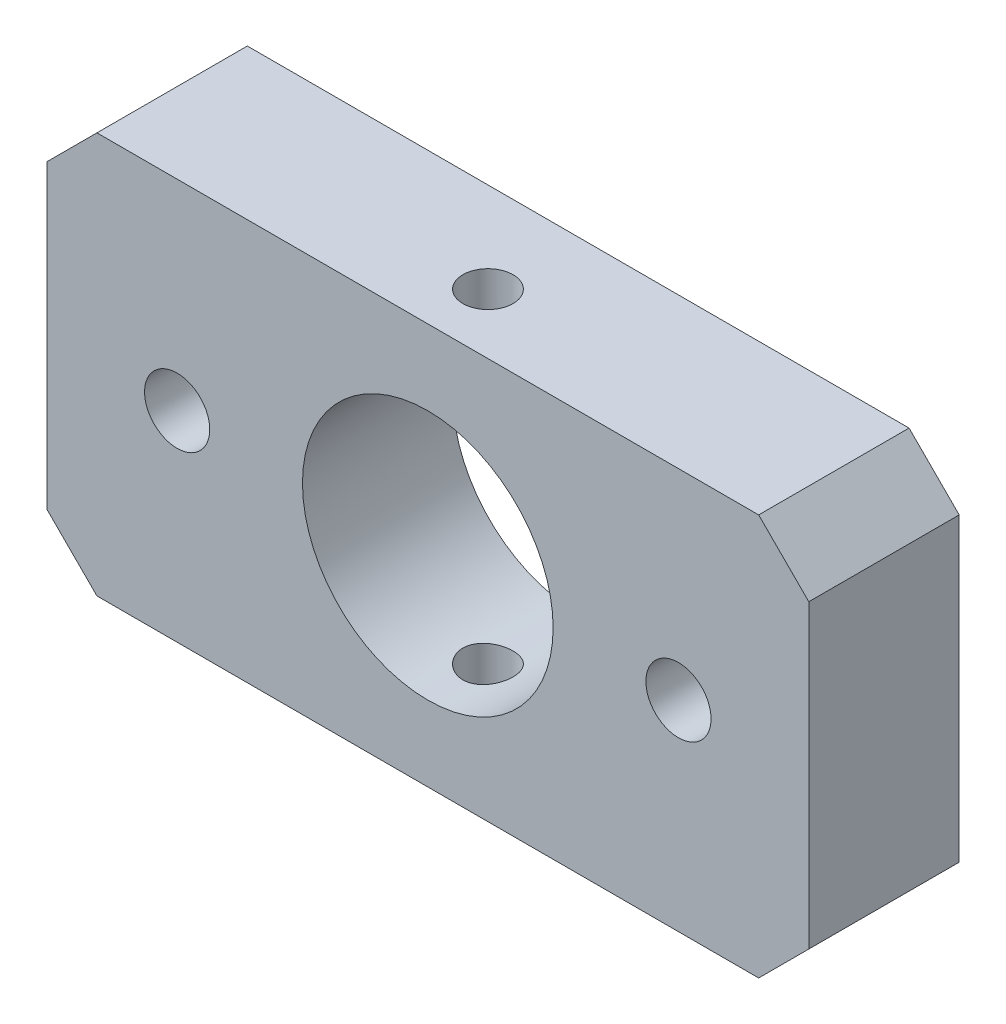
ISO-10303-21;
HEADER;
FILE_DESCRIPTION(('STEP AP214'),'2;1');
FILE_NAME('part.step','',(''),(''),'','','');
FILE_SCHEMA(('AUTOMOTIVE_DESIGN { 1 0 10303 214 1 1 1 1 }'));
ENDSEC;
DATA;
#1=APPLICATION_CONTEXT('core data for automotive mechanical design processes');
#2=APPLICATION_PROTOCOL_DEFINITION('international standard','automotive_design',2000,#1);
#3=PRODUCT_CONTEXT('',#1,'mechanical');
#4=PRODUCT('Part','Part','',(#3));
#5=PRODUCT_RELATED_PRODUCT_CATEGORY('part','',(#4));
#6=PRODUCT_DEFINITION_FORMATION('','',#4);
#7=PRODUCT_DEFINITION_CONTEXT('part definition',#1,'design');
#8=PRODUCT_DEFINITION('design','',#6,#7);
#9=PRODUCT_DEFINITION_SHAPE('','',#8);
#10=(LENGTH_UNIT() NAMED_UNIT(*) SI_UNIT(.MILLI.,.METRE.));
#11=(NAMED_UNIT(*) PLANE_ANGLE_UNIT() SI_UNIT($,.RADIAN.));
#12=(NAMED_UNIT(*) SI_UNIT($,.STERADIAN.) SOLID_ANGLE_UNIT());
#13=UNCERTAINTY_MEASURE_WITH_UNIT(LENGTH_MEASURE(1.E-05),#10,'distance_accuracy_value','');
#14=(GEOMETRIC_REPRESENTATION_CONTEXT(3) GLOBAL_UNCERTAINTY_ASSIGNED_CONTEXT((#13)) GLOBAL_UNIT_ASSIGNED_CONTEXT((#10,
#11,#12)) REPRESENTATION_CONTEXT('',''));
#15=CARTESIAN_POINT('',(0.,0.,0.));
#16=DIRECTION('',(0.,0.,1.));
#17=DIRECTION('',(1.,0.,0.));
#18=AXIS2_PLACEMENT_3D('',#15,#16,#17);
#19=CARTESIAN_POINT('',(-38.,20.,15.));
#20=DIRECTION('',(1.,0.,0.));
#21=DIRECTION('',(0.,1.,0.));
#22=AXIS2_PLACEMENT_3D('',#19,#20,#21);
#23=PLANE('',#22);
#24=DIRECTION('',(0.,-1.,0.));
#25=VECTOR('',#24,1.);
#26=CARTESIAN_POINT('',(-38.,20.,0.));
#27=LINE('',#26,#25);
#28=CARTESIAN_POINT('',(-38.,15.,0.));
#29=VERTEX_POINT('',#28);
#30=CARTESIAN_POINT('',(-38.,-15.,0.));
#31=VERTEX_POINT('',#30);
#32=EDGE_CURVE('E132',#29,#31,#27,.T.);
#33=ORIENTED_EDGE('',*,*,#32,.T.);
#34=DIRECTION('',(0.,0.,1.));
#35=VECTOR('',#34,1.);
#36=CARTESIAN_POINT('',(-38.,-15.,15.));
#37=LINE('',#36,#35);
#38=CARTESIAN_POINT('',(-38.,-15.,15.));
#39=VERTEX_POINT('',#38);
#40=EDGE_CURVE('E11',#31,#39,#37,.T.);
#41=ORIENTED_EDGE('',*,*,#40,.T.);
#42=DIRECTION('',(0.,-1.,0.));
#43=VECTOR('',#42,1.);
#44=CARTESIAN_POINT('',(-38.,20.,15.));
#45=LINE('',#44,#43);
#46=CARTESIAN_POINT('',(-38.,15.,15.));
#47=VERTEX_POINT('',#46);
#48=EDGE_CURVE('E130',#47,#39,#45,.T.);
#49=ORIENTED_EDGE('',*,*,#48,.F.);
#50=DIRECTION('',(0.,0.,-1.));
#51=VECTOR('',#50,1.);
#52=CARTESIAN_POINT('',(-38.,15.,15.));
#53=LINE('',#52,#51);
#54=EDGE_CURVE('E43',#47,#29,#53,.T.);
#55=ORIENTED_EDGE('',*,*,#54,.T.);
#56=EDGE_LOOP('',(#33,#41,#49,#55));
#57=FACE_BOUND('',#56,.T.);
#58=ADVANCED_FACE('F31',(#57),#23,.F.);
#59=CARTESIAN_POINT('',(-38.,-20.,15.));
#60=DIRECTION('',(0.,1.,0.));
#61=DIRECTION('',(-1.,0.,0.));
#62=AXIS2_PLACEMENT_3D('',#59,#60,#61);
#63=PLANE('',#62);
#64=CARTESIAN_POINT('',(0.,-20.,9.));
#65=DIRECTION('',(0.,1.,0.));
#66=DIRECTION('',(-1.,0.,0.));
#67=AXIS2_PLACEMENT_3D('',#64,#65,#66);
#68=CIRCLE('',#67,2.5);
#69=CARTESIAN_POINT('',(-2.5,-20.,9.));
#70=VERTEX_POINT('',#69);
#71=EDGE_CURVE('E265',#70,#70,#68,.T.);
#72=ORIENTED_EDGE('',*,*,#71,.T.);
#73=EDGE_LOOP('',(#72));
#74=FACE_BOUND('',#73,.T.);
#75=DIRECTION('',(1.,0.,0.));
#76=VECTOR('',#75,1.);
#77=CARTESIAN_POINT('',(-38.,-20.,0.));
#78=LINE('',#77,#76);
#79=CARTESIAN_POINT('',(-33.,-20.,0.));
#80=VERTEX_POINT('',#79);
#81=CARTESIAN_POINT('',(33.,-20.,0.));
#82=VERTEX_POINT('',#81);
#83=EDGE_CURVE('E128',#80,#82,#78,.T.);
#84=ORIENTED_EDGE('',*,*,#83,.T.);
#85=DIRECTION('',(0.,0.,1.));
#86=VECTOR('',#85,1.);
#87=CARTESIAN_POINT('',(33.,-20.,15.));
#88=LINE('',#87,#86);
#89=CARTESIAN_POINT('',(33.,-20.,15.));
#90=VERTEX_POINT('',#89);
#91=EDGE_CURVE('E107',#82,#90,#88,.T.);
#92=ORIENTED_EDGE('',*,*,#91,.T.);
#93=DIRECTION('',(1.,0.,0.));
#94=VECTOR('',#93,1.);
#95=CARTESIAN_POINT('',(-38.,-20.,15.));
#96=LINE('',#95,#94);
#97=CARTESIAN_POINT('',(-33.,-20.,15.));
#98=VERTEX_POINT('',#97);
#99=EDGE_CURVE('E138',#98,#90,#96,.T.);
#100=ORIENTED_EDGE('',*,*,#99,.F.);
#101=DIRECTION('',(0.,0.,-1.));
#102=VECTOR('',#101,1.);
#103=CARTESIAN_POINT('',(-33.,-20.,15.));
#104=LINE('',#103,#102);
#105=EDGE_CURVE('E112',#98,#80,#104,.T.);
#106=ORIENTED_EDGE('',*,*,#105,.T.);
#107=EDGE_LOOP('',(#84,#92,#100,#106));
#108=FACE_BOUND('',#107,.T.);
#109=ADVANCED_FACE('F207',(#74,#108),#63,.F.);
#110=CARTESIAN_POINT('',(38.,20.,15.));
#111=DIRECTION('',(-1.,0.,0.));
#112=DIRECTION('',(0.,0.,1.));
#113=AXIS2_PLACEMENT_3D('',#110,#111,#112);
#114=PLANE('',#113);
#115=DIRECTION('',(0.,1.,0.));
#116=VECTOR('',#115,1.);
#117=CARTESIAN_POINT('',(38.,20.,15.));
#118=LINE('',#117,#116);
#119=CARTESIAN_POINT('',(38.,-15.,15.));
#120=VERTEX_POINT('',#119);
#121=CARTESIAN_POINT('',(38.,15.,15.));
#122=VERTEX_POINT('',#121);
#123=EDGE_CURVE('E121',#120,#122,#118,.T.);
#124=ORIENTED_EDGE('',*,*,#123,.F.);
#125=DIRECTION('',(0.,0.,-1.));
#126=VECTOR('',#125,1.);
#127=CARTESIAN_POINT('',(38.,-15.,15.));
#128=LINE('',#127,#126);
#129=CARTESIAN_POINT('',(38.,-15.,0.));
#130=VERTEX_POINT('',#129);
#131=EDGE_CURVE('E106',#120,#130,#128,.T.);
#132=ORIENTED_EDGE('',*,*,#131,.T.);
#133=DIRECTION('',(0.,1.,0.));
#134=VECTOR('',#133,1.);
#135=CARTESIAN_POINT('',(38.,20.,0.));
#136=LINE('',#135,#134);
#137=CARTESIAN_POINT('',(38.,15.,0.));
#138=VERTEX_POINT('',#137);
#139=EDGE_CURVE('E119',#130,#138,#136,.T.);
#140=ORIENTED_EDGE('',*,*,#139,.T.);
#141=DIRECTION('',(0.,0.,1.));
#142=VECTOR('',#141,1.);
#143=CARTESIAN_POINT('',(38.,15.,15.));
#144=LINE('',#143,#142);
#145=EDGE_CURVE('E123',#138,#122,#144,.T.);
#146=ORIENTED_EDGE('',*,*,#145,.T.);
#147=EDGE_LOOP('',(#124,#132,#140,#146));
#148=FACE_BOUND('',#147,.T.);
#149=ADVANCED_FACE('F118',(#148),#114,.F.);
#150=CARTESIAN_POINT('',(-38.,20.,15.));
#151=DIRECTION('',(0.,-1.,0.));
#152=DIRECTION('',(0.,0.,-1.));
#153=AXIS2_PLACEMENT_3D('',#150,#151,#152);
#154=PLANE('',#153);
#155=CARTESIAN_POINT('',(0.,20.,9.));
#156=DIRECTION('',(0.,1.,0.));
#157=DIRECTION('',(0.,0.,1.));
#158=AXIS2_PLACEMENT_3D('',#155,#156,#157);
#159=CIRCLE('',#158,2.5);
#160=CARTESIAN_POINT('',(0.,20.,11.5));
#161=VERTEX_POINT('',#160);
#162=EDGE_CURVE('E168',#161,#161,#159,.T.);
#163=ORIENTED_EDGE('',*,*,#162,.F.);
#164=EDGE_LOOP('',(#163));
#165=FACE_BOUND('',#164,.T.);
#166=DIRECTION('',(-1.,0.,0.));
#167=VECTOR('',#166,1.);
#168=CARTESIAN_POINT('',(-38.,20.,15.));
#169=LINE('',#168,#167);
#170=CARTESIAN_POINT('',(33.,20.,15.));
#171=VERTEX_POINT('',#170);
#172=CARTESIAN_POINT('',(-33.,20.,15.));
#173=VERTEX_POINT('',#172);
#174=EDGE_CURVE('E142',#171,#173,#169,.T.);
#175=ORIENTED_EDGE('',*,*,#174,.F.);
#176=DIRECTION('',(0.,0.,-1.));
#177=VECTOR('',#176,1.);
#178=CARTESIAN_POINT('',(33.,20.,15.));
#179=LINE('',#178,#177);
#180=CARTESIAN_POINT('',(33.,20.,0.));
#181=VERTEX_POINT('',#180);
#182=EDGE_CURVE('E160',#171,#181,#179,.T.);
#183=ORIENTED_EDGE('',*,*,#182,.T.);
#184=DIRECTION('',(-1.,0.,0.));
#185=VECTOR('',#184,1.);
#186=CARTESIAN_POINT('',(-38.,20.,0.));
#187=LINE('',#186,#185);
#188=CARTESIAN_POINT('',(-33.,20.,0.));
#189=VERTEX_POINT('',#188);
#190=EDGE_CURVE('E127',#181,#189,#187,.T.);
#191=ORIENTED_EDGE('',*,*,#190,.T.);
#192=DIRECTION('',(0.,0.,1.));
#193=VECTOR('',#192,1.);
#194=CARTESIAN_POINT('',(-33.,20.,15.));
#195=LINE('',#194,#193);
#196=EDGE_CURVE('E51',#189,#173,#195,.T.);
#197=ORIENTED_EDGE('',*,*,#196,.T.);
#198=EDGE_LOOP('',(#175,#183,#191,#197));
#199=FACE_BOUND('',#198,.T.);
#200=ADVANCED_FACE('F225',(#165,#199),#154,.F.);
#201=CARTESIAN_POINT('',(-38.,20.,15.));
#202=DIRECTION('',(0.,0.,1.));
#203=DIRECTION('',(1.,0.,0.));
#204=AXIS2_PLACEMENT_3D('',#201,#202,#203);
#205=PLANE('',#204);
#206=CARTESIAN_POINT('',(-25.,0.,15.));
#207=DIRECTION('',(0.,0.,1.));
#208=DIRECTION('',(1.,0.,0.));
#209=AXIS2_PLACEMENT_3D('',#206,#207,#208);
#210=CIRCLE('',#209,3.25);
#211=CARTESIAN_POINT('',(-21.75,0.,15.));
#212=VERTEX_POINT('',#211);
#213=EDGE_CURVE('E262',#212,#212,#210,.T.);
#214=ORIENTED_EDGE('',*,*,#213,.F.);
#215=EDGE_LOOP('',(#214));
#216=FACE_BOUND('',#215,.T.);
#217=CARTESIAN_POINT('',(25.,0.,15.));
#218=DIRECTION('',(0.,0.,1.));
#219=DIRECTION('',(1.,0.,0.));
#220=AXIS2_PLACEMENT_3D('',#217,#218,#219);
#221=CIRCLE('',#220,3.25);
#222=CARTESIAN_POINT('',(28.25,0.,15.));
#223=VERTEX_POINT('',#222);
#224=EDGE_CURVE('E258',#223,#223,#221,.T.);
#225=ORIENTED_EDGE('',*,*,#224,.F.);
#226=EDGE_LOOP('',(#225));
#227=FACE_BOUND('',#226,.T.);
#228=CARTESIAN_POINT('',(0.,0.,15.));
#229=DIRECTION('',(0.,0.,1.));
#230=DIRECTION('',(1.,0.,0.));
#231=AXIS2_PLACEMENT_3D('',#228,#229,#230);
#232=CIRCLE('',#231,12.5);
#233=CARTESIAN_POINT('',(12.5,0.,15.));
#234=VERTEX_POINT('',#233);
#235=EDGE_CURVE('E252',#234,#234,#232,.T.);
#236=ORIENTED_EDGE('',*,*,#235,.F.);
#237=EDGE_LOOP('',(#236));
#238=FACE_BOUND('',#237,.T.);
#239=ORIENTED_EDGE('',*,*,#99,.T.);
#240=DIRECTION('',(-0.707106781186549,-0.707106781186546,0.));
#241=VECTOR('',#240,1.);
#242=CARTESIAN_POINT('',(17.4999999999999,-35.5000000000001,15.));
#243=LINE('',#242,#241);
#244=EDGE_CURVE('E157',#90,#120,#243,.F.);
#245=ORIENTED_EDGE('',*,*,#244,.T.);
#246=ORIENTED_EDGE('',*,*,#123,.T.);
#247=DIRECTION('',(0.707106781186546,-0.70710678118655,0.));
#248=VECTOR('',#247,1.);
#249=CARTESIAN_POINT('',(-2.49999999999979,55.5,15.));
#250=LINE('',#249,#248);
#251=EDGE_CURVE('E58',#122,#171,#250,.F.);
#252=ORIENTED_EDGE('',*,*,#251,.T.);
#253=ORIENTED_EDGE('',*,*,#174,.T.);
#254=DIRECTION('',(0.707106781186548,0.707106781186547,0.));
#255=VECTOR('',#254,1.);
#256=CARTESIAN_POINT('',(-35.5,17.5,15.));
#257=LINE('',#256,#255);
#258=EDGE_CURVE('E152',#173,#47,#257,.F.);
#259=ORIENTED_EDGE('',*,*,#258,.T.);
#260=ORIENTED_EDGE('',*,*,#48,.T.);
#261=DIRECTION('',(-0.707106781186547,0.707106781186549,0.));
#262=VECTOR('',#261,1.);
#263=CARTESIAN_POINT('',(-55.5,2.50000000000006,15.));
#264=LINE('',#263,#262);
#265=EDGE_CURVE('E154',#39,#98,#264,.F.);
#266=ORIENTED_EDGE('',*,*,#265,.T.);
#267=EDGE_LOOP('',(#239,#245,#246,#252,#253,#259,#260,#266));
#268=FACE_BOUND('',#267,.T.);
#269=ADVANCED_FACE('F222',(#216,#227,#238,#268),#205,.T.);
#270=CARTESIAN_POINT('',(-38.,20.,0.));
#271=DIRECTION('',(0.,0.,1.));
#272=DIRECTION('',(1.,0.,0.));
#273=AXIS2_PLACEMENT_3D('',#270,#271,#272);
#274=PLANE('',#273);
#275=CARTESIAN_POINT('',(-25.,0.,0.));
#276=DIRECTION('',(0.,0.,1.));
#277=DIRECTION('',(1.,0.,0.));
#278=AXIS2_PLACEMENT_3D('',#275,#276,#277);
#279=CIRCLE('',#278,3.25);
#280=CARTESIAN_POINT('',(-21.75,0.,0.));
#281=VERTEX_POINT('',#280);
#282=EDGE_CURVE('E245',#281,#281,#279,.T.);
#283=ORIENTED_EDGE('',*,*,#282,.T.);
#284=EDGE_LOOP('',(#283));
#285=FACE_BOUND('',#284,.T.);
#286=CARTESIAN_POINT('',(25.,0.,0.));
#287=DIRECTION('',(0.,0.,1.));
#288=DIRECTION('',(1.,0.,0.));
#289=AXIS2_PLACEMENT_3D('',#286,#287,#288);
#290=CIRCLE('',#289,3.25);
#291=CARTESIAN_POINT('',(28.25,0.,0.));
#292=VERTEX_POINT('',#291);
#293=EDGE_CURVE('E248',#292,#292,#290,.T.);
#294=ORIENTED_EDGE('',*,*,#293,.T.);
#295=EDGE_LOOP('',(#294));
#296=FACE_BOUND('',#295,.T.);
#297=CARTESIAN_POINT('',(0.,0.,0.));
#298=DIRECTION('',(0.,0.,1.));
#299=DIRECTION('',(1.,0.,0.));
#300=AXIS2_PLACEMENT_3D('',#297,#298,#299);
#301=CIRCLE('',#300,12.5);
#302=CARTESIAN_POINT('',(12.5,0.,0.));
#303=VERTEX_POINT('',#302);
#304=EDGE_CURVE('E218',#303,#303,#301,.T.);
#305=ORIENTED_EDGE('',*,*,#304,.T.);
#306=EDGE_LOOP('',(#305));
#307=FACE_BOUND('',#306,.T.);
#308=ORIENTED_EDGE('',*,*,#139,.F.);
#309=DIRECTION('',(0.707106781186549,0.707106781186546,0.));
#310=VECTOR('',#309,1.);
#311=CARTESIAN_POINT('',(38.,-15.,0.));
#312=LINE('',#311,#310);
#313=EDGE_CURVE('E102',#130,#82,#312,.F.);
#314=ORIENTED_EDGE('',*,*,#313,.T.);
#315=ORIENTED_EDGE('',*,*,#83,.F.);
#316=DIRECTION('',(0.707106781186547,-0.707106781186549,0.));
#317=VECTOR('',#316,1.);
#318=CARTESIAN_POINT('',(-33.,-20.,0.));
#319=LINE('',#318,#317);
#320=EDGE_CURVE('E146',#80,#31,#319,.F.);
#321=ORIENTED_EDGE('',*,*,#320,.T.);
#322=ORIENTED_EDGE('',*,*,#32,.F.);
#323=DIRECTION('',(-0.707106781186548,-0.707106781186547,0.));
#324=VECTOR('',#323,1.);
#325=CARTESIAN_POINT('',(-38.,15.,0.));
#326=LINE('',#325,#324);
#327=EDGE_CURVE('E122',#29,#189,#326,.F.);
#328=ORIENTED_EDGE('',*,*,#327,.T.);
#329=ORIENTED_EDGE('',*,*,#190,.F.);
#330=DIRECTION('',(-0.707106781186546,0.70710678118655,0.));
#331=VECTOR('',#330,1.);
#332=CARTESIAN_POINT('',(33.,20.,0.));
#333=LINE('',#332,#331);
#334=EDGE_CURVE('E113',#181,#138,#333,.F.);
#335=ORIENTED_EDGE('',*,*,#334,.T.);
#336=EDGE_LOOP('',(#308,#314,#315,#321,#322,#328,#329,#335));
#337=FACE_BOUND('',#336,.T.);
#338=ADVANCED_FACE('F125',(#285,#296,#307,#337),#274,.F.);
#339=CARTESIAN_POINT('',(0.,0.,0.));
#340=DIRECTION('',(0.,0.,1.));
#341=DIRECTION('',(1.,0.,0.));
#342=AXIS2_PLACEMENT_3D('',#339,#340,#341);
#343=CYLINDRICAL_SURFACE('',#342,12.5);
#344=CARTESIAN_POINT('',(0.,-12.5,11.5));
#345=CARTESIAN_POINT('',(-0.138942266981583,-12.4999974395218,11.4999948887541));
#346=CARTESIAN_POINT('',(-0.277949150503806,-12.4976596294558,11.4883778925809));
#347=CARTESIAN_POINT('',(-0.552033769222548,-12.4885591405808,11.4422537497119));
#348=CARTESIAN_POINT('',(-0.687108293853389,-12.4817929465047,11.4077284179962));
#349=CARTESIAN_POINT('',(-0.949325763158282,-12.4645912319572,11.316896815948));
#350=CARTESIAN_POINT('',(-1.07647616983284,-12.454159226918,11.2606114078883));
#351=CARTESIAN_POINT('',(-1.31951997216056,-12.4307599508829,11.1279193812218));
#352=CARTESIAN_POINT('',(-1.43541403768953,-12.4177928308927,11.051513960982));
#353=CARTESIAN_POINT('',(-1.65423369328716,-12.3905541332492,10.8796537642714));
#354=CARTESIAN_POINT('',(-1.75698487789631,-12.3762686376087,10.783979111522));
#355=CARTESIAN_POINT('',(-1.94509189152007,-12.3481045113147,10.5767689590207));
#356=CARTESIAN_POINT('',(-2.03044636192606,-12.3342259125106,10.4652322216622));
#357=CARTESIAN_POINT('',(-2.18207938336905,-12.3083110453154,10.2282095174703));
#358=CARTESIAN_POINT('',(-2.24817734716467,-12.2962926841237,10.1026058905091));
#359=CARTESIAN_POINT('',(-2.35826416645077,-12.2756567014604,9.8417954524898));
#360=CARTESIAN_POINT('',(-2.40225520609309,-12.267038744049,9.70658959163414));
#361=CARTESIAN_POINT('',(-2.46631324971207,-12.2543201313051,9.4322890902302));
#362=CARTESIAN_POINT('',(-2.48668624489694,-12.2501617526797,9.29326863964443));
#363=CARTESIAN_POINT('',(-2.5038803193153,-12.2466593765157,9.01372544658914));
#364=CARTESIAN_POINT('',(-2.50070380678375,-12.247314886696,8.87320285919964));
#365=CARTESIAN_POINT('',(-2.47113643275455,-12.2533137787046,8.59688302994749));
#366=CARTESIAN_POINT('',(-2.44509635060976,-12.2585863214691,8.46104648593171));
#367=CARTESIAN_POINT('',(-2.37109471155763,-12.273113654,8.19570980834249));
#368=CARTESIAN_POINT('',(-2.3231321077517,-12.2823686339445,8.06620997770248));
#369=CARTESIAN_POINT('',(-2.2063119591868,-12.3038904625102,7.816211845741));
#370=CARTESIAN_POINT('',(-2.13731537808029,-12.3161772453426,7.69578030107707));
#371=CARTESIAN_POINT('',(-1.9804839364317,-12.3423654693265,7.46807287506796));
#372=CARTESIAN_POINT('',(-1.89264691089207,-12.3562670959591,7.36079850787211));
#373=CARTESIAN_POINT('',(-1.69874983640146,-12.3844255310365,7.16042649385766));
#374=CARTESIAN_POINT('',(-1.59239040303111,-12.3986842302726,7.06761858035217));
#375=CARTESIAN_POINT('',(-1.36546256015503,-12.4257212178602,6.90111538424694));
#376=CARTESIAN_POINT('',(-1.24489396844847,-12.4384994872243,6.82742034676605));
#377=CARTESIAN_POINT('',(-0.992648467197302,-12.4611672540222,6.70118122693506));
#378=CARTESIAN_POINT('',(-0.86095454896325,-12.4710522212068,6.64867026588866));
#379=CARTESIAN_POINT('',(-0.590372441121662,-12.4867852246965,6.56659881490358));
#380=CARTESIAN_POINT('',(-0.451485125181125,-12.4926337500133,6.53703554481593));
#381=CARTESIAN_POINT('',(-0.172948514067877,-12.4995667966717,6.50210886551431));
#382=CARTESIAN_POINT('',(-0.0333508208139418,-12.5007293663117,6.49634895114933));
#383=CARTESIAN_POINT('',(0.244812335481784,-12.4983762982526,6.50812464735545));
#384=CARTESIAN_POINT('',(0.383377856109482,-12.4948609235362,6.52565894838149));
#385=CARTESIAN_POINT('',(0.654264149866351,-12.4835958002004,6.58319593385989));
#386=CARTESIAN_POINT('',(0.786629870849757,-12.4758844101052,6.62299517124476));
#387=CARTESIAN_POINT('',(1.04280906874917,-12.4570888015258,6.72370995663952));
#388=CARTESIAN_POINT('',(1.16662190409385,-12.4460043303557,6.78462708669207));
#389=CARTESIAN_POINT('',(1.40385293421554,-12.4214977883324,6.92670622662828));
#390=CARTESIAN_POINT('',(1.51712531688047,-12.4080487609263,7.00810695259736));
#391=CARTESIAN_POINT('',(1.72854504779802,-12.3803683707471,7.1885229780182));
#392=CARTESIAN_POINT('',(1.82669077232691,-12.3661369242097,7.28754016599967));
#393=CARTESIAN_POINT('',(2.00660147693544,-12.3382325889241,7.50218337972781));
#394=CARTESIAN_POINT('',(2.08809425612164,-12.3245715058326,7.61803936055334));
#395=CARTESIAN_POINT('',(2.23046355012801,-12.2996047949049,7.86202840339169));
#396=CARTESIAN_POINT('',(2.29134088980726,-12.2882990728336,7.99016097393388));
#397=CARTESIAN_POINT('',(2.3903796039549,-12.2694185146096,8.25442061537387));
#398=CARTESIAN_POINT('',(2.42865874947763,-12.2618243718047,8.3905021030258));
#399=CARTESIAN_POINT('',(2.48177162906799,-12.2511859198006,8.66733363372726));
#400=CARTESIAN_POINT('',(2.49660842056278,-12.2481410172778,8.80808306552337));
#401=CARTESIAN_POINT('',(2.50230227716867,-12.2469787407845,9.08752216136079));
#402=CARTESIAN_POINT('',(2.49358947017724,-12.2487729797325,9.22620287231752));
#403=CARTESIAN_POINT('',(2.45338076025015,-12.2568893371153,9.50007912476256));
#404=CARTESIAN_POINT('',(2.42188504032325,-12.2632114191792,9.63527469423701));
#405=CARTESIAN_POINT('',(2.33719642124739,-12.279631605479,9.89806927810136));
#406=CARTESIAN_POINT('',(2.28405626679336,-12.2897205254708,10.025685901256));
#407=CARTESIAN_POINT('',(2.15763661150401,-12.3125428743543,10.2702593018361));
#408=CARTESIAN_POINT('',(2.08435542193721,-12.3252765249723,10.3872151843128));
#409=CARTESIAN_POINT('',(1.91826478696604,-12.3522240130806,10.6092889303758));
#410=CARTESIAN_POINT('',(1.82514471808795,-12.3664593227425,10.714171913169));
#411=CARTESIAN_POINT('',(1.62266092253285,-12.3946520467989,10.9069655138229));
#412=CARTESIAN_POINT('',(1.51329346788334,-12.4086093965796,10.9948722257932));
#413=CARTESIAN_POINT('',(1.28004407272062,-12.4348458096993,11.1520866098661));
#414=CARTESIAN_POINT('',(1.15602221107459,-12.4471057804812,11.2211900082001));
#415=CARTESIAN_POINT('',(0.897915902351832,-12.468378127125,11.3374653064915));
#416=CARTESIAN_POINT('',(0.763840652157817,-12.4773934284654,11.3846569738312));
#417=CARTESIAN_POINT('',(0.52455372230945,-12.4894093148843,11.4466298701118));
#418=CARTESIAN_POINT('',(0.420704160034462,-12.4933575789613,11.4666079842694));
#419=CARTESIAN_POINT('',(0.211248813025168,-12.4986538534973,11.4932947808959));
#420=CARTESIAN_POINT('',(0.105643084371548,-12.5000019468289,11.5000038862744));
#421=CARTESIAN_POINT('',(0.,-12.5,11.5));
#422=B_SPLINE_CURVE_WITH_KNOTS('',3,(#344,#345,#346,#347,#348,#349,#350,#351,#352,#353,#354,
#355,#356,#357,#358,#359,#360,#361,#362,#363,#364,#365,#366,#367,#368,#369,#370,#371,#372,#373,
#374,#375,#376,#377,#378,#379,#380,#381,#382,#383,#384,#385,#386,#387,#388,#389,#390,#391,#392,
#393,#394,#395,#396,#397,#398,#399,#400,#401,#402,#403,#404,#405,#406,#407,#408,#409,#410,#411,
#412,#413,#414,#415,#416,#417,#418,#419,#420,#421),.UNSPECIFIED.,.T.,.F.,(4,2,2,2,2,2,2,2,2,2,2,
2,2,2,2,2,2,2,2,2,2,2,2,2,2,2,2,2,2,2,2,2,2,2,2,2,2,2,4),(0.,0.416440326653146,
0.833211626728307,1.24958433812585,1.66593225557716,2.08733167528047,2.50876399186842,
2.93402987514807,3.35925373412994,3.77890462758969,4.19851260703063,4.61179317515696,
5.02509348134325,5.44118725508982,5.85732886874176,6.28095631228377,6.70458918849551,
7.1288818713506,7.5531231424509,7.97026839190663,8.38739019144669,8.80076134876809,
9.21416348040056,9.63262665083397,10.0511347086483,10.4760157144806,10.9008797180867,
11.3235095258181,11.7460842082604,12.1609930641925,12.5758985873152,12.9897990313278,
13.4037341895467,13.8247019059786,14.2457663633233,14.6712374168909,15.096323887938,
15.4129693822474,15.7296047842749),.UNSPECIFIED.);
#423=CARTESIAN_POINT('',(0.,-12.5,11.5));
#424=VERTEX_POINT('',#423);
#425=EDGE_CURVE('E34',#424,#424,#422,.T.);
#426=ORIENTED_EDGE('',*,*,#425,.T.);
#427=EDGE_LOOP('',(#426));
#428=FACE_BOUND('',#427,.T.);
#429=CARTESIAN_POINT('',(0.,12.5,11.5));
#430=CARTESIAN_POINT('',(0.138942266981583,12.4999974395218,11.4999948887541));
#431=CARTESIAN_POINT('',(0.277949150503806,12.4976596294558,11.4883778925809));
#432=CARTESIAN_POINT('',(0.552033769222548,12.4885591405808,11.4422537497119));
#433=CARTESIAN_POINT('',(0.687108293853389,12.4817929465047,11.4077284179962));
#434=CARTESIAN_POINT('',(0.949325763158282,12.4645912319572,11.316896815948));
#435=CARTESIAN_POINT('',(1.07647616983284,12.454159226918,11.2606114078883));
#436=CARTESIAN_POINT('',(1.31951997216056,12.4307599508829,11.1279193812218));
#437=CARTESIAN_POINT('',(1.43541403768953,12.4177928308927,11.051513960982));
#438=CARTESIAN_POINT('',(1.65423369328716,12.3905541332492,10.8796537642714));
#439=CARTESIAN_POINT('',(1.75698487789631,12.3762686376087,10.783979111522));
#440=CARTESIAN_POINT('',(1.94509189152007,12.3481045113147,10.5767689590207));
#441=CARTESIAN_POINT('',(2.03044636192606,12.3342259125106,10.4652322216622));
#442=CARTESIAN_POINT('',(2.18207938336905,12.3083110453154,10.2282095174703));
#443=CARTESIAN_POINT('',(2.24817734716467,12.2962926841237,10.1026058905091));
#444=CARTESIAN_POINT('',(2.35826416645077,12.2756567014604,9.8417954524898));
#445=CARTESIAN_POINT('',(2.40225520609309,12.267038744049,9.70658959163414));
#446=CARTESIAN_POINT('',(2.46631324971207,12.2543201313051,9.4322890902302));
#447=CARTESIAN_POINT('',(2.48668624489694,12.2501617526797,9.29326863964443));
#448=CARTESIAN_POINT('',(2.5038803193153,12.2466593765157,9.01372544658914));
#449=CARTESIAN_POINT('',(2.50070380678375,12.247314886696,8.87320285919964));
#450=CARTESIAN_POINT('',(2.47113643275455,12.2533137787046,8.59688302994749));
#451=CARTESIAN_POINT('',(2.44509635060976,12.2585863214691,8.46104648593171));
#452=CARTESIAN_POINT('',(2.37109471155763,12.273113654,8.19570980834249));
#453=CARTESIAN_POINT('',(2.3231321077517,12.2823686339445,8.06620997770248));
#454=CARTESIAN_POINT('',(2.2063119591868,12.3038904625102,7.816211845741));
#455=CARTESIAN_POINT('',(2.13731537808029,12.3161772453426,7.69578030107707));
#456=CARTESIAN_POINT('',(1.9804839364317,12.3423654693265,7.46807287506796));
#457=CARTESIAN_POINT('',(1.89264691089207,12.3562670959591,7.36079850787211));
#458=CARTESIAN_POINT('',(1.69874983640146,12.3844255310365,7.16042649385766));
#459=CARTESIAN_POINT('',(1.59239040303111,12.3986842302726,7.06761858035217));
#460=CARTESIAN_POINT('',(1.36546256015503,12.4257212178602,6.90111538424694));
#461=CARTESIAN_POINT('',(1.24489396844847,12.4384994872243,6.82742034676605));
#462=CARTESIAN_POINT('',(0.992648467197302,12.4611672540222,6.70118122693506));
#463=CARTESIAN_POINT('',(0.86095454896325,12.4710522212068,6.64867026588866));
#464=CARTESIAN_POINT('',(0.590372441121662,12.4867852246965,6.56659881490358));
#465=CARTESIAN_POINT('',(0.451485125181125,12.4926337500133,6.53703554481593));
#466=CARTESIAN_POINT('',(0.172948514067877,12.4995667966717,6.50210886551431));
#467=CARTESIAN_POINT('',(0.0333508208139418,12.5007293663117,6.49634895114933));
#468=CARTESIAN_POINT('',(-0.244812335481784,12.4983762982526,6.50812464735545));
#469=CARTESIAN_POINT('',(-0.383377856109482,12.4948609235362,6.52565894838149));
#470=CARTESIAN_POINT('',(-0.654264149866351,12.4835958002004,6.58319593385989));
#471=CARTESIAN_POINT('',(-0.786629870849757,12.4758844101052,6.62299517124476));
#472=CARTESIAN_POINT('',(-1.04280906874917,12.4570888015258,6.72370995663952));
#473=CARTESIAN_POINT('',(-1.16662190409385,12.4460043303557,6.78462708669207));
#474=CARTESIAN_POINT('',(-1.40385293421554,12.4214977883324,6.92670622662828));
#475=CARTESIAN_POINT('',(-1.51712531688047,12.4080487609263,7.00810695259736));
#476=CARTESIAN_POINT('',(-1.72854504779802,12.3803683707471,7.1885229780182));
#477=CARTESIAN_POINT('',(-1.82669077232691,12.3661369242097,7.28754016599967));
#478=CARTESIAN_POINT('',(-2.00660147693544,12.3382325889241,7.50218337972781));
#479=CARTESIAN_POINT('',(-2.08809425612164,12.3245715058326,7.61803936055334));
#480=CARTESIAN_POINT('',(-2.23046355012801,12.2996047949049,7.86202840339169));
#481=CARTESIAN_POINT('',(-2.29134088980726,12.2882990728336,7.99016097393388));
#482=CARTESIAN_POINT('',(-2.3903796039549,12.2694185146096,8.25442061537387));
#483=CARTESIAN_POINT('',(-2.42865874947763,12.2618243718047,8.3905021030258));
#484=CARTESIAN_POINT('',(-2.48177162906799,12.2511859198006,8.66733363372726));
#485=CARTESIAN_POINT('',(-2.49660842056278,12.2481410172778,8.80808306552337));
#486=CARTESIAN_POINT('',(-2.50230227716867,12.2469787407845,9.08752216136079));
#487=CARTESIAN_POINT('',(-2.49358947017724,12.2487729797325,9.22620287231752));
#488=CARTESIAN_POINT('',(-2.45338076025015,12.2568893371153,9.50007912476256));
#489=CARTESIAN_POINT('',(-2.42188504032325,12.2632114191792,9.63527469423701));
#490=CARTESIAN_POINT('',(-2.33719642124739,12.279631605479,9.89806927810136));
#491=CARTESIAN_POINT('',(-2.28405626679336,12.2897205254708,10.025685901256));
#492=CARTESIAN_POINT('',(-2.15763661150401,12.3125428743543,10.2702593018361));
#493=CARTESIAN_POINT('',(-2.08435542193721,12.3252765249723,10.3872151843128));
#494=CARTESIAN_POINT('',(-1.91826478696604,12.3522240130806,10.6092889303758));
#495=CARTESIAN_POINT('',(-1.82514471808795,12.3664593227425,10.714171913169));
#496=CARTESIAN_POINT('',(-1.62266092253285,12.3946520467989,10.9069655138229));
#497=CARTESIAN_POINT('',(-1.51329346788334,12.4086093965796,10.9948722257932));
#498=CARTESIAN_POINT('',(-1.28004407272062,12.4348458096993,11.1520866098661));
#499=CARTESIAN_POINT('',(-1.15602221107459,12.4471057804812,11.2211900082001));
#500=CARTESIAN_POINT('',(-0.897915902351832,12.468378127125,11.3374653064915));
#501=CARTESIAN_POINT('',(-0.763840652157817,12.4773934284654,11.3846569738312));
#502=CARTESIAN_POINT('',(-0.52455372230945,12.4894093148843,11.4466298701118));
#503=CARTESIAN_POINT('',(-0.420704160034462,12.4933575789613,11.4666079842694));
#504=CARTESIAN_POINT('',(-0.211248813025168,12.4986538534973,11.4932947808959));
#505=CARTESIAN_POINT('',(-0.105643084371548,12.5000019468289,11.5000038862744));
#506=CARTESIAN_POINT('',(0.,12.5,11.5));
#507=B_SPLINE_CURVE_WITH_KNOTS('',3,(#429,#430,#431,#432,#433,#434,#435,#436,#437,#438,#439,
#440,#441,#442,#443,#444,#445,#446,#447,#448,#449,#450,#451,#452,#453,#454,#455,#456,#457,#458,
#459,#460,#461,#462,#463,#464,#465,#466,#467,#468,#469,#470,#471,#472,#473,#474,#475,#476,#477,
#478,#479,#480,#481,#482,#483,#484,#485,#486,#487,#488,#489,#490,#491,#492,#493,#494,#495,#496,
#497,#498,#499,#500,#501,#502,#503,#504,#505,#506),.UNSPECIFIED.,.T.,.F.,(4,2,2,2,2,2,2,2,2,2,2,
2,2,2,2,2,2,2,2,2,2,2,2,2,2,2,2,2,2,2,2,2,2,2,2,2,2,2,4),(0.,0.416440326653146,
0.833211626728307,1.24958433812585,1.66593225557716,2.08733167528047,2.50876399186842,
2.93402987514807,3.35925373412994,3.77890462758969,4.19851260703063,4.61179317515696,
5.02509348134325,5.44118725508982,5.85732886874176,6.28095631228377,6.70458918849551,
7.1288818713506,7.5531231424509,7.97026839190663,8.38739019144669,8.80076134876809,
9.21416348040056,9.63262665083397,10.0511347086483,10.4760157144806,10.9008797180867,
11.3235095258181,11.7460842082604,12.1609930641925,12.5758985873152,12.9897990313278,
13.4037341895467,13.8247019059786,14.2457663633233,14.6712374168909,15.096323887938,
15.4129693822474,15.7296047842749),.UNSPECIFIED.);
#508=CARTESIAN_POINT('',(0.,12.5,11.5));
#509=VERTEX_POINT('',#508);
#510=EDGE_CURVE('E164',#509,#509,#507,.T.);
#511=ORIENTED_EDGE('',*,*,#510,.T.);
#512=EDGE_LOOP('',(#511));
#513=FACE_BOUND('',#512,.T.);
#514=ORIENTED_EDGE('',*,*,#304,.F.);
#515=EDGE_LOOP('',(#514));
#516=FACE_BOUND('',#515,.T.);
#517=ORIENTED_EDGE('',*,*,#235,.T.);
#518=EDGE_LOOP('',(#517));
#519=FACE_BOUND('',#518,.T.);
#520=ADVANCED_FACE('F169',(#428,#513,#516,#519),#343,.F.);
#521=CARTESIAN_POINT('',(25.,0.,0.));
#522=DIRECTION('',(0.,0.,1.));
#523=DIRECTION('',(1.,0.,0.));
#524=AXIS2_PLACEMENT_3D('',#521,#522,#523);
#525=CYLINDRICAL_SURFACE('',#524,3.25);
#526=ORIENTED_EDGE('',*,*,#293,.F.);
#527=EDGE_LOOP('',(#526));
#528=FACE_BOUND('',#527,.T.);
#529=ORIENTED_EDGE('',*,*,#224,.T.);
#530=EDGE_LOOP('',(#529));
#531=FACE_BOUND('',#530,.T.);
#532=ADVANCED_FACE('F196',(#528,#531),#525,.F.);
#533=CARTESIAN_POINT('',(-25.,0.,0.));
#534=DIRECTION('',(0.,0.,1.));
#535=DIRECTION('',(1.,0.,0.));
#536=AXIS2_PLACEMENT_3D('',#533,#534,#535);
#537=CYLINDRICAL_SURFACE('',#536,3.25);
#538=ORIENTED_EDGE('',*,*,#282,.F.);
#539=EDGE_LOOP('',(#538));
#540=FACE_BOUND('',#539,.T.);
#541=ORIENTED_EDGE('',*,*,#213,.T.);
#542=EDGE_LOOP('',(#541));
#543=FACE_BOUND('',#542,.T.);
#544=ADVANCED_FACE('F194',(#540,#543),#537,.F.);
#545=CARTESIAN_POINT('',(38.,-15.,15.));
#546=DIRECTION('',(-0.707106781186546,0.707106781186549,0.));
#547=DIRECTION('',(-0.707106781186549,-0.707106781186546,0.));
#548=AXIS2_PLACEMENT_3D('',#545,#546,#547);
#549=PLANE('',#548);
#550=ORIENTED_EDGE('',*,*,#244,.F.);
#551=ORIENTED_EDGE('',*,*,#91,.F.);
#552=ORIENTED_EDGE('',*,*,#313,.F.);
#553=ORIENTED_EDGE('',*,*,#131,.F.);
#554=EDGE_LOOP('',(#550,#551,#552,#553));
#555=FACE_BOUND('',#554,.T.);
#556=ADVANCED_FACE('F105',(#555),#549,.F.);
#557=CARTESIAN_POINT('',(33.,20.,15.));
#558=DIRECTION('',(-0.707106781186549,-0.707106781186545,0.));
#559=DIRECTION('',(0.707106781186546,-0.70710678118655,0.));
#560=AXIS2_PLACEMENT_3D('',#557,#558,#559);
#561=PLANE('',#560);
#562=ORIENTED_EDGE('',*,*,#251,.F.);
#563=ORIENTED_EDGE('',*,*,#145,.F.);
#564=ORIENTED_EDGE('',*,*,#334,.F.);
#565=ORIENTED_EDGE('',*,*,#182,.F.);
#566=EDGE_LOOP('',(#562,#563,#564,#565));
#567=FACE_BOUND('',#566,.T.);
#568=ADVANCED_FACE('F187',(#567),#561,.F.);
#569=CARTESIAN_POINT('',(-33.,-20.,15.));
#570=DIRECTION('',(0.707106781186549,0.707106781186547,0.));
#571=DIRECTION('',(-0.707106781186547,0.707106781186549,0.));
#572=AXIS2_PLACEMENT_3D('',#569,#570,#571);
#573=PLANE('',#572);
#574=ORIENTED_EDGE('',*,*,#265,.F.);
#575=ORIENTED_EDGE('',*,*,#40,.F.);
#576=ORIENTED_EDGE('',*,*,#320,.F.);
#577=ORIENTED_EDGE('',*,*,#105,.F.);
#578=EDGE_LOOP('',(#574,#575,#576,#577));
#579=FACE_BOUND('',#578,.T.);
#580=ADVANCED_FACE('F183',(#579),#573,.F.);
#581=CARTESIAN_POINT('',(-38.,15.,15.));
#582=DIRECTION('',(0.707106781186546,-0.707106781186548,0.));
#583=DIRECTION('',(0.707106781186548,0.707106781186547,0.));
#584=AXIS2_PLACEMENT_3D('',#581,#582,#583);
#585=PLANE('',#584);
#586=ORIENTED_EDGE('',*,*,#258,.F.);
#587=ORIENTED_EDGE('',*,*,#196,.F.);
#588=ORIENTED_EDGE('',*,*,#327,.F.);
#589=ORIENTED_EDGE('',*,*,#54,.F.);
#590=EDGE_LOOP('',(#586,#587,#588,#589));
#591=FACE_BOUND('',#590,.T.);
#592=ADVANCED_FACE('F179',(#591),#585,.F.);
#593=CARTESIAN_POINT('',(0.,-33.2770272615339,9.));
#594=DIRECTION('',(0.,1.,0.));
#595=DIRECTION('',(0.,0.,1.));
#596=AXIS2_PLACEMENT_3D('',#593,#594,#595);
#597=CYLINDRICAL_SURFACE('',#596,2.5);
#598=ORIENTED_EDGE('',*,*,#162,.T.);
#599=EDGE_LOOP('',(#598));
#600=FACE_BOUND('',#599,.T.);
#601=ORIENTED_EDGE('',*,*,#510,.F.);
#602=EDGE_LOOP('',(#601));
#603=FACE_BOUND('',#602,.T.);
#604=ADVANCED_FACE('F177',(#600,#603),#597,.F.);
#605=ORIENTED_EDGE('',*,*,#425,.F.);
#606=EDGE_LOOP('',(#605));
#607=FACE_BOUND('',#606,.T.);
#608=ORIENTED_EDGE('',*,*,#71,.F.);
#609=EDGE_LOOP('',(#608));
#610=FACE_BOUND('',#609,.T.);
#611=ADVANCED_FACE('F173',(#607,#610),#597,.F.);
#612=CLOSED_SHELL('',(#58,#109,#149,#200,#269,#338,#520,#532,#544,#556,#568,#580,#592,#604,#611));
#613=MANIFOLD_SOLID_BREP('B2',#612);
#614=ADVANCED_BREP_SHAPE_REPRESENTATION('',(#18,#613),#14);
#615=SHAPE_DEFINITION_REPRESENTATION(#9,#614);
ENDSEC;
END-ISO-10303-21;
